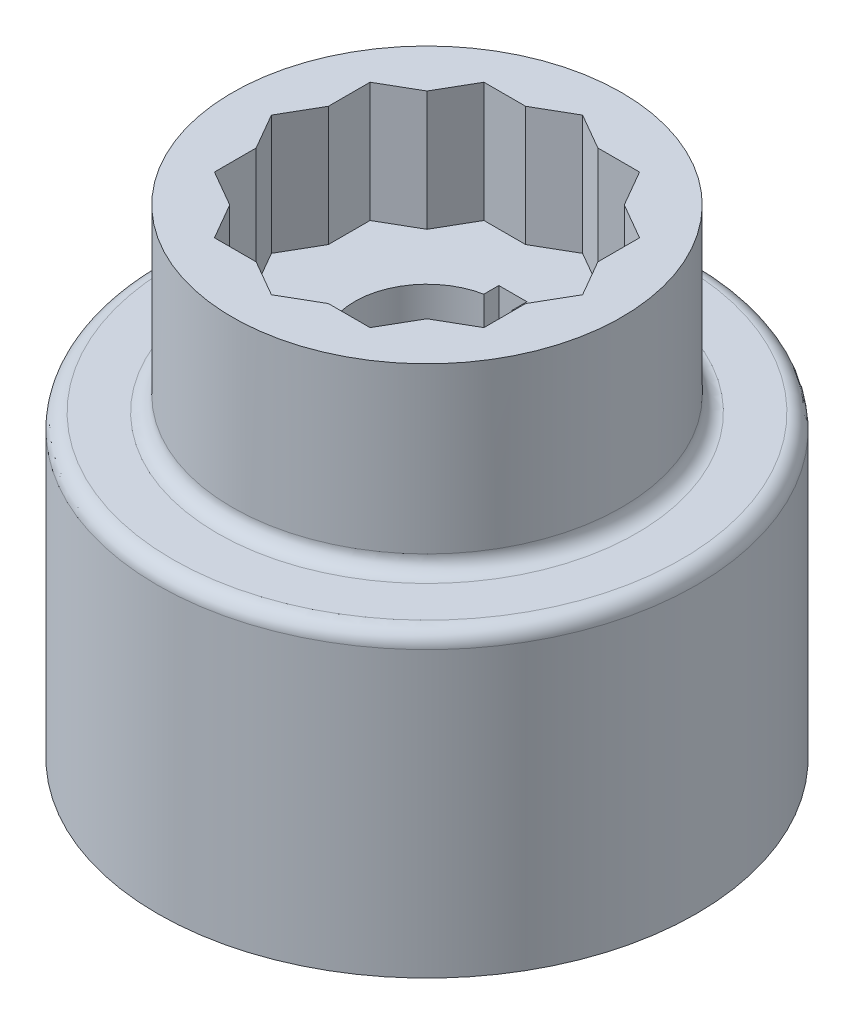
ISO-10303-21;
HEADER;
FILE_DESCRIPTION(('STEP AP214'),'2;1');
FILE_NAME('part.step','',(''),(''),'','','');
FILE_SCHEMA(('AUTOMOTIVE_DESIGN { 1 0 10303 214 1 1 1 1 }'));
ENDSEC;
DATA;
#1=APPLICATION_CONTEXT('core data for automotive mechanical design processes');
#2=APPLICATION_PROTOCOL_DEFINITION('international standard','automotive_design',2000,#1);
#3=PRODUCT_CONTEXT('',#1,'mechanical');
#4=PRODUCT('Part','Part','',(#3));
#5=PRODUCT_RELATED_PRODUCT_CATEGORY('part','',(#4));
#6=PRODUCT_DEFINITION_FORMATION('','',#4);
#7=PRODUCT_DEFINITION_CONTEXT('part definition',#1,'design');
#8=PRODUCT_DEFINITION('design','',#6,#7);
#9=PRODUCT_DEFINITION_SHAPE('','',#8);
#10=(LENGTH_UNIT() NAMED_UNIT(*) SI_UNIT(.MILLI.,.METRE.));
#11=(NAMED_UNIT(*) PLANE_ANGLE_UNIT() SI_UNIT($,.RADIAN.));
#12=(NAMED_UNIT(*) SI_UNIT($,.STERADIAN.) SOLID_ANGLE_UNIT());
#13=UNCERTAINTY_MEASURE_WITH_UNIT(LENGTH_MEASURE(1.E-05),#10,'distance_accuracy_value','');
#14=(GEOMETRIC_REPRESENTATION_CONTEXT(3) GLOBAL_UNCERTAINTY_ASSIGNED_CONTEXT((#13)) GLOBAL_UNIT_ASSIGNED_CONTEXT((#10,
#11,#12)) REPRESENTATION_CONTEXT('',''));
#15=CARTESIAN_POINT('',(0.,0.,0.));
#16=DIRECTION('',(0.,0.,1.));
#17=DIRECTION('',(1.,0.,0.));
#18=AXIS2_PLACEMENT_3D('',#15,#16,#17);
#19=CARTESIAN_POINT('',(28.575,76.2,-16.4977839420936));
#20=DIRECTION('',(0.5,0.,-0.866025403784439));
#21=DIRECTION('',(-0.866025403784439,0.,-0.5));
#22=AXIS2_PLACEMENT_3D('',#19,#20,#21);
#23=PLANE('',#22);
#24=DIRECTION('',(-0.866025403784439,0.,-0.5));
#25=VECTOR('',#24,1.);
#26=CARTESIAN_POINT('',(28.575,76.2,-16.4977839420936));
#27=LINE('',#26,#25);
#28=CARTESIAN_POINT('',(7.6566481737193,76.2,-28.575));
#29=VERTEX_POINT('',#28);
#30=CARTESIAN_POINT('',(0.,76.2,-32.9955678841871));
#31=VERTEX_POINT('',#30);
#32=EDGE_CURVE('E344',#29,#31,#27,.T.);
#33=ORIENTED_EDGE('',*,*,#32,.F.);
#34=DIRECTION('',(0.,1.,0.));
#35=VECTOR('',#34,1.);
#36=CARTESIAN_POINT('',(7.6566481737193,76.2,-28.575));
#37=LINE('',#36,#35);
#38=CARTESIAN_POINT('',(7.6566481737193,101.6,-28.575));
#39=VERTEX_POINT('',#38);
#40=EDGE_CURVE('E312',#29,#39,#37,.T.);
#41=ORIENTED_EDGE('',*,*,#40,.T.);
#42=DIRECTION('',(-0.866025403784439,0.,-0.5));
#43=VECTOR('',#42,1.);
#44=CARTESIAN_POINT('',(28.575,101.6,-16.4977839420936));
#45=LINE('',#44,#43);
#46=CARTESIAN_POINT('',(0.,101.6,-32.9955678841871));
#47=VERTEX_POINT('',#46);
#48=EDGE_CURVE('E339',#39,#47,#45,.T.);
#49=ORIENTED_EDGE('',*,*,#48,.T.);
#50=DIRECTION('',(0.,1.,0.));
#51=VECTOR('',#50,1.);
#52=CARTESIAN_POINT('',(0.,76.2,-32.9955678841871));
#53=LINE('',#52,#51);
#54=EDGE_CURVE('E364',#31,#47,#53,.T.);
#55=ORIENTED_EDGE('',*,*,#54,.F.);
#56=EDGE_LOOP('',(#33,#41,#49,#55));
#57=FACE_BOUND('',#56,.T.);
#58=ADVANCED_FACE('F31',(#57),#23,.F.);
#59=CARTESIAN_POINT('',(28.575,76.2,16.4977839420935));
#60=DIRECTION('',(1.,0.,0.));
#61=DIRECTION('',(0.,0.,-1.));
#62=AXIS2_PLACEMENT_3D('',#59,#60,#61);
#63=PLANE('',#62);
#64=DIRECTION('',(0.,0.,-1.));
#65=VECTOR('',#64,1.);
#66=CARTESIAN_POINT('',(28.575,101.6,16.4977839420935));
#67=LINE('',#66,#65);
#68=CARTESIAN_POINT('',(28.575,101.6,16.4977839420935));
#69=VERTEX_POINT('',#68);
#70=CARTESIAN_POINT('',(28.575,101.6,7.65664817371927));
#71=VERTEX_POINT('',#70);
#72=EDGE_CURVE('E385',#69,#71,#67,.T.);
#73=ORIENTED_EDGE('',*,*,#72,.T.);
#74=DIRECTION('',(0.,-1.,0.));
#75=VECTOR('',#74,1.);
#76=CARTESIAN_POINT('',(28.575,76.2,7.65664817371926));
#77=LINE('',#76,#75);
#78=CARTESIAN_POINT('',(28.575,76.2,7.65664817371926));
#79=VERTEX_POINT('',#78);
#80=EDGE_CURVE('E336',#71,#79,#77,.T.);
#81=ORIENTED_EDGE('',*,*,#80,.T.);
#82=DIRECTION('',(0.,0.,-1.));
#83=VECTOR('',#82,1.);
#84=CARTESIAN_POINT('',(28.575,76.2,16.4977839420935));
#85=LINE('',#84,#83);
#86=CARTESIAN_POINT('',(28.575,76.2,16.4977839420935));
#87=VERTEX_POINT('',#86);
#88=EDGE_CURVE('E361',#87,#79,#85,.T.);
#89=ORIENTED_EDGE('',*,*,#88,.F.);
#90=DIRECTION('',(0.,1.,0.));
#91=VECTOR('',#90,1.);
#92=CARTESIAN_POINT('',(28.575,76.2,16.4977839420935));
#93=LINE('',#92,#91);
#94=EDGE_CURVE('E392',#87,#69,#93,.T.);
#95=ORIENTED_EDGE('',*,*,#94,.T.);
#96=EDGE_LOOP('',(#73,#81,#89,#95));
#97=FACE_BOUND('',#96,.T.);
#98=ADVANCED_FACE('F443',(#97),#63,.F.);
#99=CARTESIAN_POINT('',(0.,76.2,32.9955678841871));
#100=DIRECTION('',(0.5,0.,0.866025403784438));
#101=DIRECTION('',(0.866025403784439,0.,-0.5));
#102=AXIS2_PLACEMENT_3D('',#99,#100,#101);
#103=PLANE('',#102);
#104=DIRECTION('',(0.866025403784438,0.,-0.5));
#105=VECTOR('',#104,1.);
#106=CARTESIAN_POINT('',(0.,76.2,32.9955678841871));
#107=LINE('',#106,#105);
#108=CARTESIAN_POINT('',(20.9183518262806,76.2,20.9183518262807));
#109=VERTEX_POINT('',#108);
#110=EDGE_CURVE('E356',#109,#87,#107,.T.);
#111=ORIENTED_EDGE('',*,*,#110,.F.);
#112=DIRECTION('',(0.,1.,0.));
#113=VECTOR('',#112,1.);
#114=CARTESIAN_POINT('',(20.9183518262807,76.2,20.9183518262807));
#115=LINE('',#114,#113);
#116=CARTESIAN_POINT('',(20.9183518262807,101.6,20.9183518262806));
#117=VERTEX_POINT('',#116);
#118=EDGE_CURVE('E333',#109,#117,#115,.T.);
#119=ORIENTED_EDGE('',*,*,#118,.T.);
#120=DIRECTION('',(0.866025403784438,0.,-0.5));
#121=VECTOR('',#120,1.);
#122=CARTESIAN_POINT('',(0.,101.6,32.9955678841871));
#123=LINE('',#122,#121);
#124=EDGE_CURVE('E380',#117,#69,#123,.T.);
#125=ORIENTED_EDGE('',*,*,#124,.T.);
#126=ORIENTED_EDGE('',*,*,#94,.F.);
#127=EDGE_LOOP('',(#111,#119,#125,#126));
#128=FACE_BOUND('',#127,.T.);
#129=ADVANCED_FACE('F450',(#128),#103,.F.);
#130=CARTESIAN_POINT('',(-28.575,76.2,16.4977839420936));
#131=DIRECTION('',(-0.5,0.,0.866025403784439));
#132=DIRECTION('',(0.866025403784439,0.,0.5));
#133=AXIS2_PLACEMENT_3D('',#130,#131,#132);
#134=PLANE('',#133);
#135=DIRECTION('',(0.866025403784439,0.,0.5));
#136=VECTOR('',#135,1.);
#137=CARTESIAN_POINT('',(-28.575,76.2,16.4977839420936));
#138=LINE('',#137,#136);
#139=CARTESIAN_POINT('',(-7.65664817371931,76.2,28.575));
#140=VERTEX_POINT('',#139);
#141=CARTESIAN_POINT('',(0.,76.2,32.9955678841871));
#142=VERTEX_POINT('',#141);
#143=EDGE_CURVE('E352',#140,#142,#138,.T.);
#144=ORIENTED_EDGE('',*,*,#143,.F.);
#145=DIRECTION('',(0.,1.,0.));
#146=VECTOR('',#145,1.);
#147=CARTESIAN_POINT('',(-7.6566481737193,76.2,28.575));
#148=LINE('',#147,#146);
#149=CARTESIAN_POINT('',(-7.65664817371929,101.6,28.575));
#150=VERTEX_POINT('',#149);
#151=EDGE_CURVE('E327',#140,#150,#148,.T.);
#152=ORIENTED_EDGE('',*,*,#151,.T.);
#153=DIRECTION('',(0.866025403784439,0.,0.5));
#154=VECTOR('',#153,1.);
#155=CARTESIAN_POINT('',(-28.575,101.6,16.4977839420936));
#156=LINE('',#155,#154);
#157=CARTESIAN_POINT('',(0.,101.6,32.9955678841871));
#158=VERTEX_POINT('',#157);
#159=EDGE_CURVE('E376',#150,#158,#156,.T.);
#160=ORIENTED_EDGE('',*,*,#159,.T.);
#161=DIRECTION('',(0.,1.,0.));
#162=VECTOR('',#161,1.);
#163=CARTESIAN_POINT('',(0.,76.2,32.9955678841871));
#164=LINE('',#163,#162);
#165=EDGE_CURVE('E395',#142,#158,#164,.T.);
#166=ORIENTED_EDGE('',*,*,#165,.F.);
#167=EDGE_LOOP('',(#144,#152,#160,#166));
#168=FACE_BOUND('',#167,.T.);
#169=ADVANCED_FACE('F515',(#168),#134,.F.);
#170=CARTESIAN_POINT('',(-28.575,76.2,-16.4977839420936));
#171=DIRECTION('',(-1.,0.,0.));
#172=DIRECTION('',(0.,0.,1.));
#173=AXIS2_PLACEMENT_3D('',#170,#171,#172);
#174=PLANE('',#173);
#175=DIRECTION('',(0.,0.,1.));
#176=VECTOR('',#175,1.);
#177=CARTESIAN_POINT('',(-28.575,76.2,-16.4977839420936));
#178=LINE('',#177,#176);
#179=CARTESIAN_POINT('',(-28.575,76.2,7.65664817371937));
#180=VERTEX_POINT('',#179);
#181=CARTESIAN_POINT('',(-28.575,76.2,16.4977839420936));
#182=VERTEX_POINT('',#181);
#183=EDGE_CURVE('E348',#180,#182,#178,.T.);
#184=ORIENTED_EDGE('',*,*,#183,.F.);
#185=DIRECTION('',(0.,1.,0.));
#186=VECTOR('',#185,1.);
#187=CARTESIAN_POINT('',(-28.575,76.2,7.65664817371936));
#188=LINE('',#187,#186);
#189=CARTESIAN_POINT('',(-28.575,101.6,7.65664817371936));
#190=VERTEX_POINT('',#189);
#191=EDGE_CURVE('E321',#180,#190,#188,.T.);
#192=ORIENTED_EDGE('',*,*,#191,.T.);
#193=DIRECTION('',(0.,0.,1.));
#194=VECTOR('',#193,1.);
#195=CARTESIAN_POINT('',(-28.575,101.6,-16.4977839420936));
#196=LINE('',#195,#194);
#197=CARTESIAN_POINT('',(-28.575,101.6,16.4977839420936));
#198=VERTEX_POINT('',#197);
#199=EDGE_CURVE('E372',#190,#198,#196,.T.);
#200=ORIENTED_EDGE('',*,*,#199,.T.);
#201=DIRECTION('',(0.,1.,0.));
#202=VECTOR('',#201,1.);
#203=CARTESIAN_POINT('',(-28.575,76.2,16.4977839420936));
#204=LINE('',#203,#202);
#205=EDGE_CURVE('E398',#182,#198,#204,.T.);
#206=ORIENTED_EDGE('',*,*,#205,.F.);
#207=EDGE_LOOP('',(#184,#192,#200,#206));
#208=FACE_BOUND('',#207,.T.);
#209=ADVANCED_FACE('F533',(#208),#174,.F.);
#210=CARTESIAN_POINT('',(0.,76.2,-32.9955678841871));
#211=DIRECTION('',(-0.5,0.,-0.866025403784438));
#212=DIRECTION('',(-0.866025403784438,0.,0.5));
#213=AXIS2_PLACEMENT_3D('',#210,#211,#212);
#214=PLANE('',#213);
#215=DIRECTION('',(-0.866025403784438,0.,0.5));
#216=VECTOR('',#215,1.);
#217=CARTESIAN_POINT('',(0.,76.2,-32.9955678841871));
#218=LINE('',#217,#216);
#219=CARTESIAN_POINT('',(-20.9183518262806,76.2,-20.9183518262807));
#220=VERTEX_POINT('',#219);
#221=CARTESIAN_POINT('',(-28.575,76.2,-16.4977839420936));
#222=VERTEX_POINT('',#221);
#223=EDGE_CURVE('E343',#220,#222,#218,.T.);
#224=ORIENTED_EDGE('',*,*,#223,.F.);
#225=DIRECTION('',(0.,1.,0.));
#226=VECTOR('',#225,1.);
#227=CARTESIAN_POINT('',(-20.9183518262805,76.2,-20.9183518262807));
#228=LINE('',#227,#226);
#229=CARTESIAN_POINT('',(-20.9183518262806,101.6,-20.9183518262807));
#230=VERTEX_POINT('',#229);
#231=EDGE_CURVE('E315',#220,#230,#228,.T.);
#232=ORIENTED_EDGE('',*,*,#231,.T.);
#233=DIRECTION('',(-0.866025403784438,0.,0.5));
#234=VECTOR('',#233,1.);
#235=CARTESIAN_POINT('',(0.,101.6,-32.9955678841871));
#236=LINE('',#235,#234);
#237=CARTESIAN_POINT('',(-28.575,101.6,-16.4977839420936));
#238=VERTEX_POINT('',#237);
#239=EDGE_CURVE('E368',#230,#238,#236,.T.);
#240=ORIENTED_EDGE('',*,*,#239,.T.);
#241=DIRECTION('',(0.,1.,0.));
#242=VECTOR('',#241,1.);
#243=CARTESIAN_POINT('',(-28.575,76.2,-16.4977839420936));
#244=LINE('',#243,#242);
#245=EDGE_CURVE('E401',#222,#238,#244,.T.);
#246=ORIENTED_EDGE('',*,*,#245,.F.);
#247=EDGE_LOOP('',(#224,#232,#240,#246));
#248=FACE_BOUND('',#247,.T.);
#249=ADVANCED_FACE('F551',(#248),#214,.F.);
#250=CARTESIAN_POINT('',(0.,63.5,0.));
#251=DIRECTION('',(0.,1.,0.));
#252=DIRECTION('',(0.,0.,1.));
#253=AXIS2_PLACEMENT_3D('',#250,#251,#252);
#254=PLANE('',#253);
#255=CARTESIAN_POINT('',(0.,63.5,0.));
#256=DIRECTION('',(0.,1.,0.));
#257=DIRECTION('',(0.,0.,1.));
#258=AXIS2_PLACEMENT_3D('',#255,#256,#257);
#259=CIRCLE('',#258,53.975);
#260=CARTESIAN_POINT('',(0.,63.5,53.975));
#261=VERTEX_POINT('',#260);
#262=EDGE_CURVE('E414',#261,#261,#259,.T.);
#263=ORIENTED_EDGE('',*,*,#262,.T.);
#264=EDGE_LOOP('',(#263));
#265=FACE_BOUND('',#264,.T.);
#266=CARTESIAN_POINT('',(0.,63.5,0.));
#267=DIRECTION('',(0.,1.,0.));
#268=DIRECTION('',(0.,0.,1.));
#269=AXIS2_PLACEMENT_3D('',#266,#267,#268);
#270=CIRCLE('',#269,44.45);
#271=CARTESIAN_POINT('',(0.,63.5,44.45));
#272=VERTEX_POINT('',#271);
#273=EDGE_CURVE('E411',#272,#272,#270,.F.);
#274=ORIENTED_EDGE('',*,*,#273,.T.);
#275=EDGE_LOOP('',(#274));
#276=FACE_BOUND('',#275,.T.);
#277=ADVANCED_FACE('F572',(#265,#276),#254,.T.);
#278=CARTESIAN_POINT('',(0.,63.5,0.));
#279=DIRECTION('',(0.,-1.,0.));
#280=DIRECTION('',(0.,0.,-1.));
#281=AXIS2_PLACEMENT_3D('',#278,#279,#280);
#282=CYLINDRICAL_SURFACE('',#281,57.15);
#283=CARTESIAN_POINT('',(0.,60.325,0.));
#284=DIRECTION('',(0.,1.,0.));
#285=DIRECTION('',(0.,0.,1.));
#286=AXIS2_PLACEMENT_3D('',#283,#284,#285);
#287=CIRCLE('',#286,57.15);
#288=CARTESIAN_POINT('',(0.,60.325,57.15));
#289=VERTEX_POINT('',#288);
#290=EDGE_CURVE('E417',#289,#289,#287,.F.);
#291=ORIENTED_EDGE('',*,*,#290,.T.);
#292=EDGE_LOOP('',(#291));
#293=FACE_BOUND('',#292,.T.);
#294=CARTESIAN_POINT('',(0.,0.,0.));
#295=DIRECTION('',(0.,1.,0.));
#296=DIRECTION('',(0.,0.,1.));
#297=AXIS2_PLACEMENT_3D('',#294,#295,#296);
#298=CIRCLE('',#297,57.15);
#299=CARTESIAN_POINT('',(0.,0.,57.15));
#300=VERTEX_POINT('',#299);
#301=EDGE_CURVE('E408',#300,#300,#298,.T.);
#302=ORIENTED_EDGE('',*,*,#301,.T.);
#303=EDGE_LOOP('',(#302));
#304=FACE_BOUND('',#303,.T.);
#305=ADVANCED_FACE('F577',(#293,#304),#282,.T.);
#306=CARTESIAN_POINT('',(0.,0.,0.));
#307=DIRECTION('',(0.,1.,0.));
#308=DIRECTION('',(0.,0.,1.));
#309=AXIS2_PLACEMENT_3D('',#306,#307,#308);
#310=PLANE('',#309);
#311=CARTESIAN_POINT('',(0.,0.,0.));
#312=DIRECTION('',(0.,1.,0.));
#313=DIRECTION('',(0.,0.,1.));
#314=AXIS2_PLACEMENT_3D('',#311,#312,#313);
#315=CIRCLE('',#314,6.64249795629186);
#316=CARTESIAN_POINT('',(0.,0.,6.6424979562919));
#317=VERTEX_POINT('',#316);
#318=EDGE_CURVE('E235',#317,#317,#315,.T.);
#319=ORIENTED_EDGE('',*,*,#318,.T.);
#320=EDGE_LOOP('',(#319));
#321=FACE_BOUND('',#320,.T.);
#322=ORIENTED_EDGE('',*,*,#301,.F.);
#323=EDGE_LOOP('',(#322));
#324=FACE_BOUND('',#323,.T.);
#325=ADVANCED_FACE('F628',(#321,#324),#310,.F.);
#326=CARTESIAN_POINT('',(0.,101.6,0.));
#327=DIRECTION('',(0.,-1.,0.));
#328=DIRECTION('',(0.,0.,-1.));
#329=AXIS2_PLACEMENT_3D('',#326,#327,#328);
#330=CYLINDRICAL_SURFACE('',#329,41.275);
#331=CARTESIAN_POINT('',(0.,66.675,0.));
#332=DIRECTION('',(0.,1.,0.));
#333=DIRECTION('',(0.,0.,1.));
#334=AXIS2_PLACEMENT_3D('',#331,#332,#333);
#335=CIRCLE('',#334,41.275);
#336=CARTESIAN_POINT('',(0.,66.675,-41.275));
#337=VERTEX_POINT('',#336);
#338=EDGE_CURVE('E420',#337,#337,#335,.T.);
#339=CARTESIAN_POINT('',(0.,101.6,0.));
#340=DIRECTION('',(0.,1.,0.));
#341=DIRECTION('',(0.,0.,1.));
#342=AXIS2_PLACEMENT_3D('',#339,#340,#341);
#343=CIRCLE('',#342,41.275);
#344=CARTESIAN_POINT('',(0.,101.6,-41.275));
#345=VERTEX_POINT('',#344);
#346=EDGE_CURVE('E391',#345,#345,#343,.T.);
#347=CARTESIAN_POINT('',(0.,66.675,-41.275));
#348=CARTESIAN_POINT('',(0.,67.0388020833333,-41.275));
#349=CARTESIAN_POINT('',(0.,67.4026041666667,-41.275));
#350=CARTESIAN_POINT('',(0.,68.1302083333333,-41.275));
#351=CARTESIAN_POINT('',(0.,68.4940104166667,-41.275));
#352=CARTESIAN_POINT('',(0.,69.2216145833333,-41.275));
#353=CARTESIAN_POINT('',(0.,69.5854166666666,-41.275));
#354=CARTESIAN_POINT('',(0.,70.3130208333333,-41.275));
#355=CARTESIAN_POINT('',(0.,70.6768229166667,-41.275));
#356=CARTESIAN_POINT('',(0.,71.4044270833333,-41.275));
#357=CARTESIAN_POINT('',(0.,71.7682291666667,-41.275));
#358=CARTESIAN_POINT('',(0.,72.4958333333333,-41.275));
#359=CARTESIAN_POINT('',(0.,72.8596354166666,-41.275));
#360=CARTESIAN_POINT('',(0.,73.5872395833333,-41.275));
#361=CARTESIAN_POINT('',(0.,73.9510416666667,-41.275));
#362=CARTESIAN_POINT('',(0.,74.6786458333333,-41.275));
#363=CARTESIAN_POINT('',(0.,75.0424479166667,-41.275));
#364=CARTESIAN_POINT('',(0.,75.7700520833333,-41.275));
#365=CARTESIAN_POINT('',(0.,76.1338541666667,-41.275));
#366=CARTESIAN_POINT('',(0.,76.8614583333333,-41.275));
#367=CARTESIAN_POINT('',(0.,77.2252604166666,-41.275));
#368=CARTESIAN_POINT('',(0.,77.9528645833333,-41.275));
#369=CARTESIAN_POINT('',(0.,78.3166666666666,-41.275));
#370=CARTESIAN_POINT('',(0.,79.0442708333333,-41.275));
#371=CARTESIAN_POINT('',(0.,79.4080729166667,-41.275));
#372=CARTESIAN_POINT('',(0.,80.1356770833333,-41.275));
#373=CARTESIAN_POINT('',(0.,80.4994791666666,-41.275));
#374=CARTESIAN_POINT('',(0.,81.2270833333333,-41.275));
#375=CARTESIAN_POINT('',(0.,81.5908854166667,-41.275));
#376=CARTESIAN_POINT('',(0.,82.3184895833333,-41.275));
#377=CARTESIAN_POINT('',(0.,82.6822916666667,-41.275));
#378=CARTESIAN_POINT('',(0.,83.4098958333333,-41.275));
#379=CARTESIAN_POINT('',(0.,83.7736979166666,-41.275));
#380=CARTESIAN_POINT('',(0.,84.5013020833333,-41.275));
#381=CARTESIAN_POINT('',(0.,84.8651041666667,-41.275));
#382=CARTESIAN_POINT('',(0.,85.5927083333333,-41.275));
#383=CARTESIAN_POINT('',(0.,85.9565104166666,-41.275));
#384=CARTESIAN_POINT('',(0.,86.6841145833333,-41.275));
#385=CARTESIAN_POINT('',(0.,87.0479166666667,-41.275));
#386=CARTESIAN_POINT('',(0.,87.7755208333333,-41.275));
#387=CARTESIAN_POINT('',(0.,88.1393229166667,-41.275));
#388=CARTESIAN_POINT('',(0.,88.8669270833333,-41.275));
#389=CARTESIAN_POINT('',(0.,89.2307291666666,-41.275));
#390=CARTESIAN_POINT('',(0.,89.9583333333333,-41.275));
#391=CARTESIAN_POINT('',(0.,90.3221354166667,-41.275));
#392=CARTESIAN_POINT('',(0.,91.0497395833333,-41.275));
#393=CARTESIAN_POINT('',(0.,91.4135416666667,-41.275));
#394=CARTESIAN_POINT('',(0.,92.1411458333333,-41.275));
#395=CARTESIAN_POINT('',(0.,92.5049479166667,-41.275));
#396=CARTESIAN_POINT('',(0.,93.2325520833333,-41.275));
#397=CARTESIAN_POINT('',(0.,93.5963541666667,-41.275));
#398=CARTESIAN_POINT('',(0.,94.3239583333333,-41.275));
#399=CARTESIAN_POINT('',(0.,94.6877604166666,-41.275));
#400=CARTESIAN_POINT('',(0.,95.4153645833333,-41.275));
#401=CARTESIAN_POINT('',(0.,95.7791666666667,-41.275));
#402=CARTESIAN_POINT('',(0.,96.5067708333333,-41.275));
#403=CARTESIAN_POINT('',(0.,96.8705729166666,-41.275));
#404=CARTESIAN_POINT('',(0.,97.5981770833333,-41.275));
#405=CARTESIAN_POINT('',(0.,97.9619791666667,-41.275));
#406=CARTESIAN_POINT('',(0.,98.6895833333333,-41.275));
#407=CARTESIAN_POINT('',(0.,99.0533854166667,-41.275));
#408=CARTESIAN_POINT('',(0.,99.7809895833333,-41.275));
#409=CARTESIAN_POINT('',(0.,100.144791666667,-41.275));
#410=CARTESIAN_POINT('',(0.,100.872395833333,-41.275));
#411=CARTESIAN_POINT('',(0.,101.236197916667,-41.275));
#412=CARTESIAN_POINT('',(0.,101.6,-41.275));
#413=B_SPLINE_CURVE_WITH_KNOTS('',3,(#347,#348,#349,#350,#351,#352,#353,#354,#355,#356,#357,
#358,#359,#360,#361,#362,#363,#364,#365,#366,#367,#368,#369,#370,#371,#372,#373,#374,#375,#376,
#377,#378,#379,#380,#381,#382,#383,#384,#385,#386,#387,#388,#389,#390,#391,#392,#393,#394,#395,
#396,#397,#398,#399,#400,#401,#402,#403,#404,#405,#406,#407,#408,#409,#410,#411,#412),
.UNSPECIFIED.,.F.,.F.,(4,2,2,2,2,2,2,2,2,2,2,2,2,2,2,2,2,2,2,2,2,2,2,2,2,2,2,2,2,2,2,2,4),(0.,
1.09140625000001,2.18281250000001,3.27421875,4.36562500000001,5.45703125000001,6.5484375,
7.63984375,8.73125000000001,9.82265625,10.9140625,12.00546875,13.096875,14.18828125,15.2796875,
16.37109375,17.4625,18.55390625,19.6453125,20.73671875,21.828125,22.91953125,24.0109375,
25.10234375,26.19375,27.28515625,28.3765625,29.46796875,30.559375,31.65078125,32.7421875,
33.83359375,34.925),.UNSPECIFIED.);
#414=EDGE_CURVE('BSEAM633',#337,#345,#413,.T.);
#415=ORIENTED_EDGE('',*,*,#338,.T.);
#416=ORIENTED_EDGE('',*,*,#346,.F.);
#417=ORIENTED_EDGE('',*,*,#414,.T.);
#418=ORIENTED_EDGE('',*,*,#414,.F.);
#419=EDGE_LOOP('',(#415,#417,#416,#418));
#420=FACE_BOUND('',#419,.T.);
#421=ADVANCED_FACE('F633',(#420),#330,.T.);
#422=CARTESIAN_POINT('',(0.,101.6,0.));
#423=DIRECTION('',(0.,1.,0.));
#424=DIRECTION('',(0.,0.,1.));
#425=AXIS2_PLACEMENT_3D('',#422,#423,#424);
#426=PLANE('',#425);
#427=DIRECTION('',(0.499999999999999,0.,-0.866025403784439));
#428=VECTOR('',#427,1.);
#429=CARTESIAN_POINT('',(16.4977839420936,101.6,28.575));
#430=LINE('',#429,#428);
#431=CARTESIAN_POINT('',(16.4977839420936,101.6,28.575));
#432=VERTEX_POINT('',#431);
#433=EDGE_CURVE('E269',#432,#117,#430,.T.);
#434=ORIENTED_EDGE('',*,*,#433,.F.);
#435=DIRECTION('',(1.,0.,0.));
#436=VECTOR('',#435,1.);
#437=CARTESIAN_POINT('',(-16.4977839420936,101.6,28.575));
#438=LINE('',#437,#436);
#439=CARTESIAN_POINT('',(7.65664817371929,101.6,28.575));
#440=VERTEX_POINT('',#439);
#441=EDGE_CURVE('E283',#440,#432,#438,.T.);
#442=ORIENTED_EDGE('',*,*,#441,.F.);
#443=EDGE_CURVE('E381',#158,#440,#123,.T.);
#444=ORIENTED_EDGE('',*,*,#443,.F.);
#445=ORIENTED_EDGE('',*,*,#159,.F.);
#446=CARTESIAN_POINT('',(-16.4977839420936,101.6,28.575));
#447=VERTEX_POINT('',#446);
#448=EDGE_CURVE('E284',#447,#150,#438,.T.);
#449=ORIENTED_EDGE('',*,*,#448,.F.);
#450=DIRECTION('',(0.5,0.,0.866025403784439));
#451=VECTOR('',#450,1.);
#452=CARTESIAN_POINT('',(-32.9955678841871,101.6,0.));
#453=LINE('',#452,#451);
#454=CARTESIAN_POINT('',(-20.9183518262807,101.6,20.9183518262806));
#455=VERTEX_POINT('',#454);
#456=EDGE_CURVE('E280',#455,#447,#453,.T.);
#457=ORIENTED_EDGE('',*,*,#456,.F.);
#458=EDGE_CURVE('E377',#198,#455,#156,.T.);
#459=ORIENTED_EDGE('',*,*,#458,.F.);
#460=ORIENTED_EDGE('',*,*,#199,.F.);
#461=CARTESIAN_POINT('',(-32.9955678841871,101.6,0.));
#462=VERTEX_POINT('',#461);
#463=EDGE_CURVE('E281',#462,#190,#453,.T.);
#464=ORIENTED_EDGE('',*,*,#463,.F.);
#465=DIRECTION('',(-0.500000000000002,0.,0.866025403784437));
#466=VECTOR('',#465,1.);
#467=CARTESIAN_POINT('',(-16.4977839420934,101.6,-28.575));
#468=LINE('',#467,#466);
#469=CARTESIAN_POINT('',(-28.575,101.6,-7.65664817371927));
#470=VERTEX_POINT('',#469);
#471=EDGE_CURVE('E277',#470,#462,#468,.T.);
#472=ORIENTED_EDGE('',*,*,#471,.F.);
#473=EDGE_CURVE('E373',#238,#470,#196,.T.);
#474=ORIENTED_EDGE('',*,*,#473,.F.);
#475=ORIENTED_EDGE('',*,*,#239,.F.);
#476=CARTESIAN_POINT('',(-16.4977839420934,101.6,-28.575));
#477=VERTEX_POINT('',#476);
#478=EDGE_CURVE('E278',#477,#230,#468,.T.);
#479=ORIENTED_EDGE('',*,*,#478,.F.);
#480=DIRECTION('',(-1.,0.,0.));
#481=VECTOR('',#480,1.);
#482=CARTESIAN_POINT('',(16.4977839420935,101.6,-28.575));
#483=LINE('',#482,#481);
#484=CARTESIAN_POINT('',(-7.6566481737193,101.6,-28.575));
#485=VERTEX_POINT('',#484);
#486=EDGE_CURVE('E274',#485,#477,#483,.T.);
#487=ORIENTED_EDGE('',*,*,#486,.F.);
#488=EDGE_CURVE('E369',#47,#485,#236,.T.);
#489=ORIENTED_EDGE('',*,*,#488,.F.);
#490=ORIENTED_EDGE('',*,*,#48,.F.);
#491=CARTESIAN_POINT('',(16.4977839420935,101.6,-28.575));
#492=VERTEX_POINT('',#491);
#493=EDGE_CURVE('E275',#492,#39,#483,.T.);
#494=ORIENTED_EDGE('',*,*,#493,.F.);
#495=DIRECTION('',(-0.5,0.,-0.866025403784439));
#496=VECTOR('',#495,1.);
#497=CARTESIAN_POINT('',(32.9955678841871,101.6,0.));
#498=LINE('',#497,#496);
#499=CARTESIAN_POINT('',(20.9183518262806,101.6,-20.9183518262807));
#500=VERTEX_POINT('',#499);
#501=EDGE_CURVE('E271',#500,#492,#498,.T.);
#502=ORIENTED_EDGE('',*,*,#501,.F.);
#503=CARTESIAN_POINT('',(28.575,101.6,-16.4977839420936));
#504=VERTEX_POINT('',#503);
#505=EDGE_CURVE('E365',#504,#500,#45,.T.);
#506=ORIENTED_EDGE('',*,*,#505,.F.);
#507=CARTESIAN_POINT('',(28.575,101.6,-7.65664817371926));
#508=VERTEX_POINT('',#507);
#509=EDGE_CURVE('E384',#508,#504,#67,.T.);
#510=ORIENTED_EDGE('',*,*,#509,.F.);
#511=CARTESIAN_POINT('',(32.9955678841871,101.6,0.));
#512=VERTEX_POINT('',#511);
#513=EDGE_CURVE('E272',#512,#508,#498,.T.);
#514=ORIENTED_EDGE('',*,*,#513,.F.);
#515=EDGE_CURVE('E246',#71,#512,#430,.T.);
#516=ORIENTED_EDGE('',*,*,#515,.F.);
#517=ORIENTED_EDGE('',*,*,#72,.F.);
#518=ORIENTED_EDGE('',*,*,#124,.F.);
#519=EDGE_LOOP('',(#434,#442,#444,#445,#449,#457,#459,#460,#464,#472,#474,#475,#479,#487,#489,
#490,#494,#502,#506,#510,#514,#516,#517,#518));
#520=FACE_BOUND('',#519,.T.);
#521=ORIENTED_EDGE('',*,*,#346,.T.);
#522=EDGE_LOOP('',(#521));
#523=FACE_BOUND('',#522,.T.);
#524=ADVANCED_FACE('F474',(#520,#523),#426,.T.);
#525=CARTESIAN_POINT('',(0.,60.325,0.));
#526=DIRECTION('',(0.,1.,0.));
#527=DIRECTION('',(0.,0.,1.));
#528=AXIS2_PLACEMENT_3D('',#525,#526,#527);
#529=TOROIDAL_SURFACE('',#528,53.975,3.175);
#530=ORIENTED_EDGE('',*,*,#290,.F.);
#531=EDGE_LOOP('',(#530));
#532=FACE_BOUND('',#531,.T.);
#533=ORIENTED_EDGE('',*,*,#262,.F.);
#534=EDGE_LOOP('',(#533));
#535=FACE_BOUND('',#534,.T.);
#536=ADVANCED_FACE('F465',(#532,#535),#529,.T.);
#537=CARTESIAN_POINT('',(0.,66.675,0.));
#538=DIRECTION('',(0.,1.,0.));
#539=DIRECTION('',(0.,0.,1.));
#540=AXIS2_PLACEMENT_3D('',#537,#538,#539);
#541=TOROIDAL_SURFACE('',#540,44.45,3.175);
#542=ORIENTED_EDGE('',*,*,#273,.F.);
#543=EDGE_LOOP('',(#542));
#544=FACE_BOUND('',#543,.T.);
#545=ORIENTED_EDGE('',*,*,#338,.F.);
#546=EDGE_LOOP('',(#545));
#547=FACE_BOUND('',#546,.T.);
#548=ADVANCED_FACE('F33',(#544,#547),#541,.F.);
#549=ORIENTED_EDGE('',*,*,#505,.T.);
#550=DIRECTION('',(0.,-1.,0.));
#551=VECTOR('',#550,1.);
#552=CARTESIAN_POINT('',(20.9183518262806,76.2,-20.9183518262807));
#553=LINE('',#552,#551);
#554=CARTESIAN_POINT('',(20.9183518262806,76.2,-20.9183518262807));
#555=VERTEX_POINT('',#554);
#556=EDGE_CURVE('E306',#500,#555,#553,.T.);
#557=ORIENTED_EDGE('',*,*,#556,.T.);
#558=CARTESIAN_POINT('',(28.575,76.2,-16.4977839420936));
#559=VERTEX_POINT('',#558);
#560=EDGE_CURVE('E340',#559,#555,#27,.T.);
#561=ORIENTED_EDGE('',*,*,#560,.F.);
#562=DIRECTION('',(0.,1.,0.));
#563=VECTOR('',#562,1.);
#564=CARTESIAN_POINT('',(28.575,76.2,-16.4977839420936));
#565=LINE('',#564,#563);
#566=EDGE_CURVE('E388',#559,#504,#565,.T.);
#567=ORIENTED_EDGE('',*,*,#566,.T.);
#568=EDGE_LOOP('',(#549,#557,#561,#567));
#569=FACE_BOUND('',#568,.T.);
#570=ADVANCED_FACE('F446',(#569),#23,.F.);
#571=CARTESIAN_POINT('',(28.575,76.2,-7.65664817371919));
#572=VERTEX_POINT('',#571);
#573=EDGE_CURVE('E360',#572,#559,#85,.T.);
#574=ORIENTED_EDGE('',*,*,#573,.F.);
#575=DIRECTION('',(0.,1.,0.));
#576=VECTOR('',#575,1.);
#577=CARTESIAN_POINT('',(28.575,76.2,-7.65664817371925));
#578=LINE('',#577,#576);
#579=EDGE_CURVE('E289',#572,#508,#578,.T.);
#580=ORIENTED_EDGE('',*,*,#579,.T.);
#581=ORIENTED_EDGE('',*,*,#509,.T.);
#582=ORIENTED_EDGE('',*,*,#566,.F.);
#583=EDGE_LOOP('',(#574,#580,#581,#582));
#584=FACE_BOUND('',#583,.T.);
#585=ADVANCED_FACE('F453',(#584),#63,.F.);
#586=ORIENTED_EDGE('',*,*,#443,.T.);
#587=DIRECTION('',(0.,-1.,0.));
#588=VECTOR('',#587,1.);
#589=CARTESIAN_POINT('',(7.65664817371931,76.2,28.575));
#590=LINE('',#589,#588);
#591=CARTESIAN_POINT('',(7.65664817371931,76.2,28.575));
#592=VERTEX_POINT('',#591);
#593=EDGE_CURVE('E330',#440,#592,#590,.T.);
#594=ORIENTED_EDGE('',*,*,#593,.T.);
#595=EDGE_CURVE('E357',#142,#592,#107,.T.);
#596=ORIENTED_EDGE('',*,*,#595,.F.);
#597=ORIENTED_EDGE('',*,*,#165,.T.);
#598=EDGE_LOOP('',(#586,#594,#596,#597));
#599=FACE_BOUND('',#598,.T.);
#600=ADVANCED_FACE('F463',(#599),#103,.F.);
#601=ORIENTED_EDGE('',*,*,#458,.T.);
#602=DIRECTION('',(0.,-1.,0.));
#603=VECTOR('',#602,1.);
#604=CARTESIAN_POINT('',(-20.9183518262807,76.2,20.9183518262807));
#605=LINE('',#604,#603);
#606=CARTESIAN_POINT('',(-20.9183518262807,76.2,20.9183518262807));
#607=VERTEX_POINT('',#606);
#608=EDGE_CURVE('E324',#455,#607,#605,.T.);
#609=ORIENTED_EDGE('',*,*,#608,.T.);
#610=EDGE_CURVE('E353',#182,#607,#138,.T.);
#611=ORIENTED_EDGE('',*,*,#610,.F.);
#612=ORIENTED_EDGE('',*,*,#205,.T.);
#613=EDGE_LOOP('',(#601,#609,#611,#612));
#614=FACE_BOUND('',#613,.T.);
#615=ADVANCED_FACE('F527',(#614),#134,.F.);
#616=ORIENTED_EDGE('',*,*,#473,.T.);
#617=DIRECTION('',(0.,-1.,0.));
#618=VECTOR('',#617,1.);
#619=CARTESIAN_POINT('',(-28.575,76.2,-7.65664817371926));
#620=LINE('',#619,#618);
#621=CARTESIAN_POINT('',(-28.575,76.2,-7.65664817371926));
#622=VERTEX_POINT('',#621);
#623=EDGE_CURVE('E318',#470,#622,#620,.T.);
#624=ORIENTED_EDGE('',*,*,#623,.T.);
#625=EDGE_CURVE('E349',#222,#622,#178,.T.);
#626=ORIENTED_EDGE('',*,*,#625,.F.);
#627=ORIENTED_EDGE('',*,*,#245,.T.);
#628=EDGE_LOOP('',(#616,#624,#626,#627));
#629=FACE_BOUND('',#628,.T.);
#630=ADVANCED_FACE('F545',(#629),#174,.F.);
#631=ORIENTED_EDGE('',*,*,#488,.T.);
#632=DIRECTION('',(0.,-1.,0.));
#633=VECTOR('',#632,1.);
#634=CARTESIAN_POINT('',(-7.65664817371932,76.2,-28.575));
#635=LINE('',#634,#633);
#636=CARTESIAN_POINT('',(-7.65664817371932,76.2,-28.575));
#637=VERTEX_POINT('',#636);
#638=EDGE_CURVE('E309',#485,#637,#635,.T.);
#639=ORIENTED_EDGE('',*,*,#638,.T.);
#640=EDGE_CURVE('E345',#31,#637,#218,.T.);
#641=ORIENTED_EDGE('',*,*,#640,.F.);
#642=ORIENTED_EDGE('',*,*,#54,.T.);
#643=EDGE_LOOP('',(#631,#639,#641,#642));
#644=FACE_BOUND('',#643,.T.);
#645=ADVANCED_FACE('F563',(#644),#214,.F.);
#646=CARTESIAN_POINT('',(0.,76.2,-32.9955678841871));
#647=DIRECTION('',(0.,1.,0.));
#648=DIRECTION('',(0.,0.,1.));
#649=AXIS2_PLACEMENT_3D('',#646,#647,#648);
#650=PLANE('',#649);
#651=CARTESIAN_POINT('',(0.,76.2,0.));
#652=DIRECTION('',(0.,1.,0.));
#653=DIRECTION('',(0.,0.,1.));
#654=AXIS2_PLACEMENT_3D('',#651,#652,#653);
#655=CIRCLE('',#654,15.3335555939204);
#656=CARTESIAN_POINT('',(-2.98170480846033,76.2,-15.0408564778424));
#657=VERTEX_POINT('',#656);
#658=CARTESIAN_POINT('',(2.98170480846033,76.2,-15.0408564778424));
#659=VERTEX_POINT('',#658);
#660=EDGE_CURVE('E11',#657,#659,#655,.T.);
#661=ORIENTED_EDGE('',*,*,#660,.F.);
#662=DIRECTION('',(0.,0.,1.));
#663=VECTOR('',#662,1.);
#664=CARTESIAN_POINT('',(-2.98170480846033,76.2,-32.9955678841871));
#665=LINE('',#664,#663);
#666=CARTESIAN_POINT('',(-2.98170480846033,76.2,-18.2158564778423));
#667=VERTEX_POINT('',#666);
#668=EDGE_CURVE('E39',#667,#657,#665,.T.);
#669=ORIENTED_EDGE('',*,*,#668,.F.);
#670=DIRECTION('',(-1.,0.,0.));
#671=VECTOR('',#670,1.);
#672=CARTESIAN_POINT('',(0.,76.2,-18.2158564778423));
#673=LINE('',#672,#671);
#674=CARTESIAN_POINT('',(2.98170480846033,76.2,-18.2158564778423));
#675=VERTEX_POINT('',#674);
#676=EDGE_CURVE('E425',#675,#667,#673,.T.);
#677=ORIENTED_EDGE('',*,*,#676,.F.);
#678=DIRECTION('',(0.,0.,-1.));
#679=VECTOR('',#678,1.);
#680=CARTESIAN_POINT('',(2.98170480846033,76.2,-32.9955678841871));
#681=LINE('',#680,#679);
#682=EDGE_CURVE('E423',#659,#675,#681,.T.);
#683=ORIENTED_EDGE('',*,*,#682,.F.);
#684=EDGE_LOOP('',(#661,#669,#677,#683));
#685=FACE_BOUND('',#684,.T.);
#686=ORIENTED_EDGE('',*,*,#560,.T.);
#687=DIRECTION('',(-0.5,0.,-0.866025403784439));
#688=VECTOR('',#687,1.);
#689=CARTESIAN_POINT('',(32.9955678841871,76.2,0.));
#690=LINE('',#689,#688);
#691=CARTESIAN_POINT('',(16.4977839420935,76.2,-28.575));
#692=VERTEX_POINT('',#691);
#693=EDGE_CURVE('E253',#555,#692,#690,.T.);
#694=ORIENTED_EDGE('',*,*,#693,.T.);
#695=DIRECTION('',(-1.,0.,0.));
#696=VECTOR('',#695,1.);
#697=CARTESIAN_POINT('',(16.4977839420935,76.2,-28.575));
#698=LINE('',#697,#696);
#699=EDGE_CURVE('E257',#692,#29,#698,.T.);
#700=ORIENTED_EDGE('',*,*,#699,.T.);
#701=ORIENTED_EDGE('',*,*,#32,.T.);
#702=ORIENTED_EDGE('',*,*,#640,.T.);
#703=CARTESIAN_POINT('',(-16.4977839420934,76.2,-28.575));
#704=VERTEX_POINT('',#703);
#705=EDGE_CURVE('E256',#637,#704,#698,.T.);
#706=ORIENTED_EDGE('',*,*,#705,.T.);
#707=DIRECTION('',(-0.500000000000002,0.,0.866025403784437));
#708=VECTOR('',#707,1.);
#709=CARTESIAN_POINT('',(-16.4977839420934,76.2,-28.575));
#710=LINE('',#709,#708);
#711=EDGE_CURVE('E260',#704,#220,#710,.T.);
#712=ORIENTED_EDGE('',*,*,#711,.T.);
#713=ORIENTED_EDGE('',*,*,#223,.T.);
#714=ORIENTED_EDGE('',*,*,#625,.T.);
#715=CARTESIAN_POINT('',(-32.9955678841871,76.2,0.));
#716=VERTEX_POINT('',#715);
#717=EDGE_CURVE('E259',#622,#716,#710,.T.);
#718=ORIENTED_EDGE('',*,*,#717,.T.);
#719=DIRECTION('',(0.5,0.,0.866025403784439));
#720=VECTOR('',#719,1.);
#721=CARTESIAN_POINT('',(-32.9955678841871,76.2,0.));
#722=LINE('',#721,#720);
#723=EDGE_CURVE('E263',#716,#180,#722,.T.);
#724=ORIENTED_EDGE('',*,*,#723,.T.);
#725=ORIENTED_EDGE('',*,*,#183,.T.);
#726=ORIENTED_EDGE('',*,*,#610,.T.);
#727=CARTESIAN_POINT('',(-16.4977839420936,76.2,28.575));
#728=VERTEX_POINT('',#727);
#729=EDGE_CURVE('E262',#607,#728,#722,.T.);
#730=ORIENTED_EDGE('',*,*,#729,.T.);
#731=DIRECTION('',(1.,0.,0.));
#732=VECTOR('',#731,1.);
#733=CARTESIAN_POINT('',(-16.4977839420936,76.2,28.575));
#734=LINE('',#733,#732);
#735=EDGE_CURVE('E266',#728,#140,#734,.T.);
#736=ORIENTED_EDGE('',*,*,#735,.T.);
#737=ORIENTED_EDGE('',*,*,#143,.T.);
#738=ORIENTED_EDGE('',*,*,#595,.T.);
#739=CARTESIAN_POINT('',(16.4977839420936,76.2,28.575));
#740=VERTEX_POINT('',#739);
#741=EDGE_CURVE('E265',#592,#740,#734,.T.);
#742=ORIENTED_EDGE('',*,*,#741,.T.);
#743=DIRECTION('',(0.499999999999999,0.,-0.866025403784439));
#744=VECTOR('',#743,1.);
#745=CARTESIAN_POINT('',(16.4977839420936,76.2,28.575));
#746=LINE('',#745,#744);
#747=EDGE_CURVE('E251',#740,#109,#746,.T.);
#748=ORIENTED_EDGE('',*,*,#747,.T.);
#749=ORIENTED_EDGE('',*,*,#110,.T.);
#750=ORIENTED_EDGE('',*,*,#88,.T.);
#751=CARTESIAN_POINT('',(32.9955678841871,76.2,0.));
#752=VERTEX_POINT('',#751);
#753=EDGE_CURVE('E254',#79,#752,#746,.T.);
#754=ORIENTED_EDGE('',*,*,#753,.T.);
#755=EDGE_CURVE('E53',#752,#572,#690,.T.);
#756=ORIENTED_EDGE('',*,*,#755,.T.);
#757=ORIENTED_EDGE('',*,*,#573,.T.);
#758=EDGE_LOOP('',(#686,#694,#700,#701,#702,#706,#712,#713,#714,#718,#724,#725,#726,#730,#736,
#737,#738,#742,#748,#749,#750,#754,#756,#757));
#759=FACE_BOUND('',#758,.T.);
#760=ADVANCED_FACE('F431',(#685,#759),#650,.T.);
#761=CARTESIAN_POINT('',(16.4977839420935,76.2,-28.575));
#762=DIRECTION('',(0.,0.,-1.));
#763=DIRECTION('',(-1.,0.,0.));
#764=AXIS2_PLACEMENT_3D('',#761,#762,#763);
#765=PLANE('',#764);
#766=ORIENTED_EDGE('',*,*,#486,.T.);
#767=DIRECTION('',(0.,1.,0.));
#768=VECTOR('',#767,1.);
#769=CARTESIAN_POINT('',(-16.4977839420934,76.2,-28.575));
#770=LINE('',#769,#768);
#771=EDGE_CURVE('E296',#704,#477,#770,.T.);
#772=ORIENTED_EDGE('',*,*,#771,.F.);
#773=ORIENTED_EDGE('',*,*,#705,.F.);
#774=ORIENTED_EDGE('',*,*,#638,.F.);
#775=EDGE_LOOP('',(#766,#772,#773,#774));
#776=FACE_BOUND('',#775,.T.);
#777=ADVANCED_FACE('F560',(#776),#765,.F.);
#778=CARTESIAN_POINT('',(-16.4977839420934,76.2,-28.575));
#779=DIRECTION('',(-0.866025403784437,0.,-0.500000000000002));
#780=DIRECTION('',(-0.500000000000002,0.,0.866025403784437));
#781=AXIS2_PLACEMENT_3D('',#778,#779,#780);
#782=PLANE('',#781);
#783=ORIENTED_EDGE('',*,*,#711,.F.);
#784=ORIENTED_EDGE('',*,*,#771,.T.);
#785=ORIENTED_EDGE('',*,*,#478,.T.);
#786=ORIENTED_EDGE('',*,*,#231,.F.);
#787=EDGE_LOOP('',(#783,#784,#785,#786));
#788=FACE_BOUND('',#787,.T.);
#789=ADVANCED_FACE('F557',(#788),#782,.F.);
#790=ORIENTED_EDGE('',*,*,#471,.T.);
#791=DIRECTION('',(0.,1.,0.));
#792=VECTOR('',#791,1.);
#793=CARTESIAN_POINT('',(-32.9955678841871,76.2,0.));
#794=LINE('',#793,#792);
#795=EDGE_CURVE('E293',#716,#462,#794,.T.);
#796=ORIENTED_EDGE('',*,*,#795,.F.);
#797=ORIENTED_EDGE('',*,*,#717,.F.);
#798=ORIENTED_EDGE('',*,*,#623,.F.);
#799=EDGE_LOOP('',(#790,#796,#797,#798));
#800=FACE_BOUND('',#799,.T.);
#801=ADVANCED_FACE('F542',(#800),#782,.F.);
#802=CARTESIAN_POINT('',(-32.9955678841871,76.2,0.));
#803=DIRECTION('',(-0.866025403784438,0.,0.5));
#804=DIRECTION('',(0.5,0.,0.866025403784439));
#805=AXIS2_PLACEMENT_3D('',#802,#803,#804);
#806=PLANE('',#805);
#807=ORIENTED_EDGE('',*,*,#723,.F.);
#808=ORIENTED_EDGE('',*,*,#795,.T.);
#809=ORIENTED_EDGE('',*,*,#463,.T.);
#810=ORIENTED_EDGE('',*,*,#191,.F.);
#811=EDGE_LOOP('',(#807,#808,#809,#810));
#812=FACE_BOUND('',#811,.T.);
#813=ADVANCED_FACE('F539',(#812),#806,.F.);
#814=ORIENTED_EDGE('',*,*,#456,.T.);
#815=DIRECTION('',(0.,1.,0.));
#816=VECTOR('',#815,1.);
#817=CARTESIAN_POINT('',(-16.4977839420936,76.2,28.575));
#818=LINE('',#817,#816);
#819=EDGE_CURVE('E290',#728,#447,#818,.T.);
#820=ORIENTED_EDGE('',*,*,#819,.F.);
#821=ORIENTED_EDGE('',*,*,#729,.F.);
#822=ORIENTED_EDGE('',*,*,#608,.F.);
#823=EDGE_LOOP('',(#814,#820,#821,#822));
#824=FACE_BOUND('',#823,.T.);
#825=ADVANCED_FACE('F524',(#824),#806,.F.);
#826=CARTESIAN_POINT('',(-16.4977839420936,76.2,28.575));
#827=DIRECTION('',(0.,0.,1.));
#828=DIRECTION('',(1.,0.,0.));
#829=AXIS2_PLACEMENT_3D('',#826,#827,#828);
#830=PLANE('',#829);
#831=ORIENTED_EDGE('',*,*,#735,.F.);
#832=ORIENTED_EDGE('',*,*,#819,.T.);
#833=ORIENTED_EDGE('',*,*,#448,.T.);
#834=ORIENTED_EDGE('',*,*,#151,.F.);
#835=EDGE_LOOP('',(#831,#832,#833,#834));
#836=FACE_BOUND('',#835,.T.);
#837=ADVANCED_FACE('F521',(#836),#830,.F.);
#838=ORIENTED_EDGE('',*,*,#441,.T.);
#839=DIRECTION('',(0.,1.,0.));
#840=VECTOR('',#839,1.);
#841=CARTESIAN_POINT('',(16.4977839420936,76.2,28.575));
#842=LINE('',#841,#840);
#843=EDGE_CURVE('E286',#740,#432,#842,.T.);
#844=ORIENTED_EDGE('',*,*,#843,.F.);
#845=ORIENTED_EDGE('',*,*,#741,.F.);
#846=ORIENTED_EDGE('',*,*,#593,.F.);
#847=EDGE_LOOP('',(#838,#844,#845,#846));
#848=FACE_BOUND('',#847,.T.);
#849=ADVANCED_FACE('F507',(#848),#830,.F.);
#850=CARTESIAN_POINT('',(16.4977839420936,76.2,28.575));
#851=DIRECTION('',(0.866025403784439,0.,0.499999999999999));
#852=DIRECTION('',(0.499999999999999,0.,-0.86602540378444));
#853=AXIS2_PLACEMENT_3D('',#850,#851,#852);
#854=PLANE('',#853);
#855=ORIENTED_EDGE('',*,*,#747,.F.);
#856=ORIENTED_EDGE('',*,*,#843,.T.);
#857=ORIENTED_EDGE('',*,*,#433,.T.);
#858=ORIENTED_EDGE('',*,*,#118,.F.);
#859=EDGE_LOOP('',(#855,#856,#857,#858));
#860=FACE_BOUND('',#859,.T.);
#861=ADVANCED_FACE('F504',(#860),#854,.F.);
#862=CARTESIAN_POINT('',(32.9955678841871,76.2,0.));
#863=DIRECTION('',(0.866025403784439,0.,-0.5));
#864=DIRECTION('',(-0.5,0.,-0.866025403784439));
#865=AXIS2_PLACEMENT_3D('',#862,#863,#864);
#866=PLANE('',#865);
#867=ORIENTED_EDGE('',*,*,#755,.F.);
#868=DIRECTION('',(0.,1.,0.));
#869=VECTOR('',#868,1.);
#870=CARTESIAN_POINT('',(32.9955678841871,76.2,0.));
#871=LINE('',#870,#869);
#872=EDGE_CURVE('E268',#752,#512,#871,.T.);
#873=ORIENTED_EDGE('',*,*,#872,.T.);
#874=ORIENTED_EDGE('',*,*,#513,.T.);
#875=ORIENTED_EDGE('',*,*,#579,.F.);
#876=EDGE_LOOP('',(#867,#873,#874,#875));
#877=FACE_BOUND('',#876,.T.);
#878=ADVANCED_FACE('F489',(#877),#866,.F.);
#879=ORIENTED_EDGE('',*,*,#515,.T.);
#880=ORIENTED_EDGE('',*,*,#872,.F.);
#881=ORIENTED_EDGE('',*,*,#753,.F.);
#882=ORIENTED_EDGE('',*,*,#80,.F.);
#883=EDGE_LOOP('',(#879,#880,#881,#882));
#884=FACE_BOUND('',#883,.T.);
#885=ADVANCED_FACE('F588',(#884),#854,.F.);
#886=ORIENTED_EDGE('',*,*,#699,.F.);
#887=DIRECTION('',(0.,1.,0.));
#888=VECTOR('',#887,1.);
#889=CARTESIAN_POINT('',(16.4977839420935,76.2,-28.575));
#890=LINE('',#889,#888);
#891=EDGE_CURVE('E299',#692,#492,#890,.T.);
#892=ORIENTED_EDGE('',*,*,#891,.T.);
#893=ORIENTED_EDGE('',*,*,#493,.T.);
#894=ORIENTED_EDGE('',*,*,#40,.F.);
#895=EDGE_LOOP('',(#886,#892,#893,#894));
#896=FACE_BOUND('',#895,.T.);
#897=ADVANCED_FACE('F484',(#896),#765,.F.);
#898=ORIENTED_EDGE('',*,*,#501,.T.);
#899=ORIENTED_EDGE('',*,*,#891,.F.);
#900=ORIENTED_EDGE('',*,*,#693,.F.);
#901=ORIENTED_EDGE('',*,*,#556,.F.);
#902=EDGE_LOOP('',(#898,#899,#900,#901));
#903=FACE_BOUND('',#902,.T.);
#904=ADVANCED_FACE('F481',(#903),#866,.F.);
#905=CARTESIAN_POINT('',(0.,63.5,0.));
#906=DIRECTION('',(0.,1.,0.));
#907=DIRECTION('',(0.,0.,1.));
#908=AXIS2_PLACEMENT_3D('',#905,#906,#907);
#909=CYLINDRICAL_SURFACE('',#908,15.3335555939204);
#910=ORIENTED_EDGE('',*,*,#660,.T.);
#911=DIRECTION('',(0.,1.,0.));
#912=VECTOR('',#911,1.);
#913=CARTESIAN_POINT('',(2.98170480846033,63.5,-15.0408564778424));
#914=LINE('',#913,#912);
#915=CARTESIAN_POINT('',(2.98170480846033,63.5,-15.0408564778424));
#916=VERTEX_POINT('',#915);
#917=EDGE_CURVE('E46',#916,#659,#914,.T.);
#918=ORIENTED_EDGE('',*,*,#917,.F.);
#919=CARTESIAN_POINT('',(0.,63.5,0.));
#920=DIRECTION('',(0.,1.,0.));
#921=DIRECTION('',(0.,0.,-1.));
#922=AXIS2_PLACEMENT_3D('',#919,#920,#921);
#923=CIRCLE('',#922,15.3335555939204);
#924=CARTESIAN_POINT('',(-2.98170480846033,63.5,-15.0408564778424));
#925=VERTEX_POINT('',#924);
#926=EDGE_CURVE('E217',#925,#916,#923,.T.);
#927=ORIENTED_EDGE('',*,*,#926,.F.);
#928=DIRECTION('',(0.,1.,0.));
#929=VECTOR('',#928,1.);
#930=CARTESIAN_POINT('',(-2.98170480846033,63.5,-15.0408564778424));
#931=LINE('',#930,#929);
#932=EDGE_CURVE('E244',#925,#657,#931,.T.);
#933=ORIENTED_EDGE('',*,*,#932,.T.);
#934=EDGE_LOOP('',(#910,#918,#927,#933));
#935=FACE_BOUND('',#934,.T.);
#936=ADVANCED_FACE('F214',(#935),#909,.F.);
#937=CARTESIAN_POINT('',(-2.98170480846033,63.5,-15.0408564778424));
#938=DIRECTION('',(-1.,0.,0.));
#939=DIRECTION('',(0.,0.,1.));
#940=AXIS2_PLACEMENT_3D('',#937,#938,#939);
#941=PLANE('',#940);
#942=ORIENTED_EDGE('',*,*,#668,.T.);
#943=ORIENTED_EDGE('',*,*,#932,.F.);
#944=DIRECTION('',(0.,0.,1.));
#945=VECTOR('',#944,1.);
#946=CARTESIAN_POINT('',(-2.98170480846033,63.5,-15.0408564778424));
#947=LINE('',#946,#945);
#948=CARTESIAN_POINT('',(-2.98170480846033,63.5,-18.2158564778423));
#949=VERTEX_POINT('',#948);
#950=EDGE_CURVE('E222',#949,#925,#947,.T.);
#951=ORIENTED_EDGE('',*,*,#950,.F.);
#952=DIRECTION('',(0.,1.,0.));
#953=VECTOR('',#952,1.);
#954=CARTESIAN_POINT('',(-2.98170480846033,63.5,-18.2158564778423));
#955=LINE('',#954,#953);
#956=EDGE_CURVE('E247',#949,#667,#955,.T.);
#957=ORIENTED_EDGE('',*,*,#956,.T.);
#958=EDGE_LOOP('',(#942,#943,#951,#957));
#959=FACE_BOUND('',#958,.T.);
#960=ADVANCED_FACE('F428',(#959),#941,.F.);
#961=CARTESIAN_POINT('',(-2.98170480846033,63.5,-18.2158564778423));
#962=DIRECTION('',(0.,0.,-1.));
#963=DIRECTION('',(-1.,0.,0.));
#964=AXIS2_PLACEMENT_3D('',#961,#962,#963);
#965=PLANE('',#964);
#966=ORIENTED_EDGE('',*,*,#676,.T.);
#967=ORIENTED_EDGE('',*,*,#956,.F.);
#968=DIRECTION('',(-1.,0.,0.));
#969=VECTOR('',#968,1.);
#970=CARTESIAN_POINT('',(-2.98170480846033,63.5,-18.2158564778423));
#971=LINE('',#970,#969);
#972=CARTESIAN_POINT('',(2.98170480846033,63.5,-18.2158564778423));
#973=VERTEX_POINT('',#972);
#974=EDGE_CURVE('E231',#973,#949,#971,.T.);
#975=ORIENTED_EDGE('',*,*,#974,.F.);
#976=DIRECTION('',(0.,1.,0.));
#977=VECTOR('',#976,1.);
#978=CARTESIAN_POINT('',(2.98170480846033,63.5,-18.2158564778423));
#979=LINE('',#978,#977);
#980=EDGE_CURVE('E221',#973,#675,#979,.T.);
#981=ORIENTED_EDGE('',*,*,#980,.T.);
#982=EDGE_LOOP('',(#966,#967,#975,#981));
#983=FACE_BOUND('',#982,.T.);
#984=ADVANCED_FACE('F433',(#983),#965,.F.);
#985=CARTESIAN_POINT('',(2.98170480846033,63.5,-18.2158564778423));
#986=DIRECTION('',(1.,0.,0.));
#987=DIRECTION('',(0.,0.,-1.));
#988=AXIS2_PLACEMENT_3D('',#985,#986,#987);
#989=PLANE('',#988);
#990=ORIENTED_EDGE('',*,*,#682,.T.);
#991=ORIENTED_EDGE('',*,*,#980,.F.);
#992=DIRECTION('',(0.,0.,-1.));
#993=VECTOR('',#992,1.);
#994=CARTESIAN_POINT('',(2.98170480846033,63.5,-18.2158564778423));
#995=LINE('',#994,#993);
#996=EDGE_CURVE('E225',#916,#973,#995,.T.);
#997=ORIENTED_EDGE('',*,*,#996,.F.);
#998=ORIENTED_EDGE('',*,*,#917,.T.);
#999=EDGE_LOOP('',(#990,#991,#997,#998));
#1000=FACE_BOUND('',#999,.T.);
#1001=ADVANCED_FACE('F226',(#1000),#989,.F.);
#1002=CARTESIAN_POINT('',(0.,63.5,0.));
#1003=DIRECTION('',(0.,-1.,0.));
#1004=DIRECTION('',(0.,0.,-1.));
#1005=AXIS2_PLACEMENT_3D('',#1002,#1003,#1004);
#1006=PLANE('',#1005);
#1007=CARTESIAN_POINT('',(0.,63.5,0.));
#1008=DIRECTION('',(0.,1.,0.));
#1009=DIRECTION('',(0.,0.,1.));
#1010=AXIS2_PLACEMENT_3D('',#1007,#1008,#1009);
#1011=CIRCLE('',#1010,6.64249795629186);
#1012=CARTESIAN_POINT('',(0.,63.5,6.6424979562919));
#1013=VERTEX_POINT('',#1012);
#1014=EDGE_CURVE('E238',#1013,#1013,#1011,.T.);
#1015=ORIENTED_EDGE('',*,*,#1014,.F.);
#1016=EDGE_LOOP('',(#1015));
#1017=FACE_BOUND('',#1016,.T.);
#1018=ORIENTED_EDGE('',*,*,#926,.T.);
#1019=ORIENTED_EDGE('',*,*,#996,.T.);
#1020=ORIENTED_EDGE('',*,*,#974,.T.);
#1021=ORIENTED_EDGE('',*,*,#950,.T.);
#1022=EDGE_LOOP('',(#1018,#1019,#1020,#1021));
#1023=FACE_BOUND('',#1022,.T.);
#1024=ADVANCED_FACE('F233',(#1017,#1023),#1006,.F.);
#1025=CARTESIAN_POINT('',(0.,0.,0.));
#1026=DIRECTION('',(0.,1.,0.));
#1027=DIRECTION('',(0.,0.,1.));
#1028=AXIS2_PLACEMENT_3D('',#1025,#1026,#1027);
#1029=CYLINDRICAL_SURFACE('',#1028,6.64249795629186);
#1030=ORIENTED_EDGE('',*,*,#318,.F.);
#1031=EDGE_LOOP('',(#1030));
#1032=FACE_BOUND('',#1031,.T.);
#1033=ORIENTED_EDGE('',*,*,#1014,.T.);
#1034=EDGE_LOOP('',(#1033));
#1035=FACE_BOUND('',#1034,.T.);
#1036=ADVANCED_FACE('F645',(#1032,#1035),#1029,.F.);
#1037=CLOSED_SHELL('',(#58,#98,#129,#169,#209,#249,#277,#305,#325,#421,#524,#536,#548,#570,#585,
#600,#615,#630,#645,#760,#777,#789,#801,#813,#825,#837,#849,#861,#878,#885,#897,#904,#936,#960,
#984,#1001,#1024,#1036));
#1038=MANIFOLD_SOLID_BREP('B2',#1037);
#1039=ADVANCED_BREP_SHAPE_REPRESENTATION('',(#18,#1038),#14);
#1040=SHAPE_DEFINITION_REPRESENTATION(#9,#1039);
ENDSEC;
END-ISO-10303-21;
